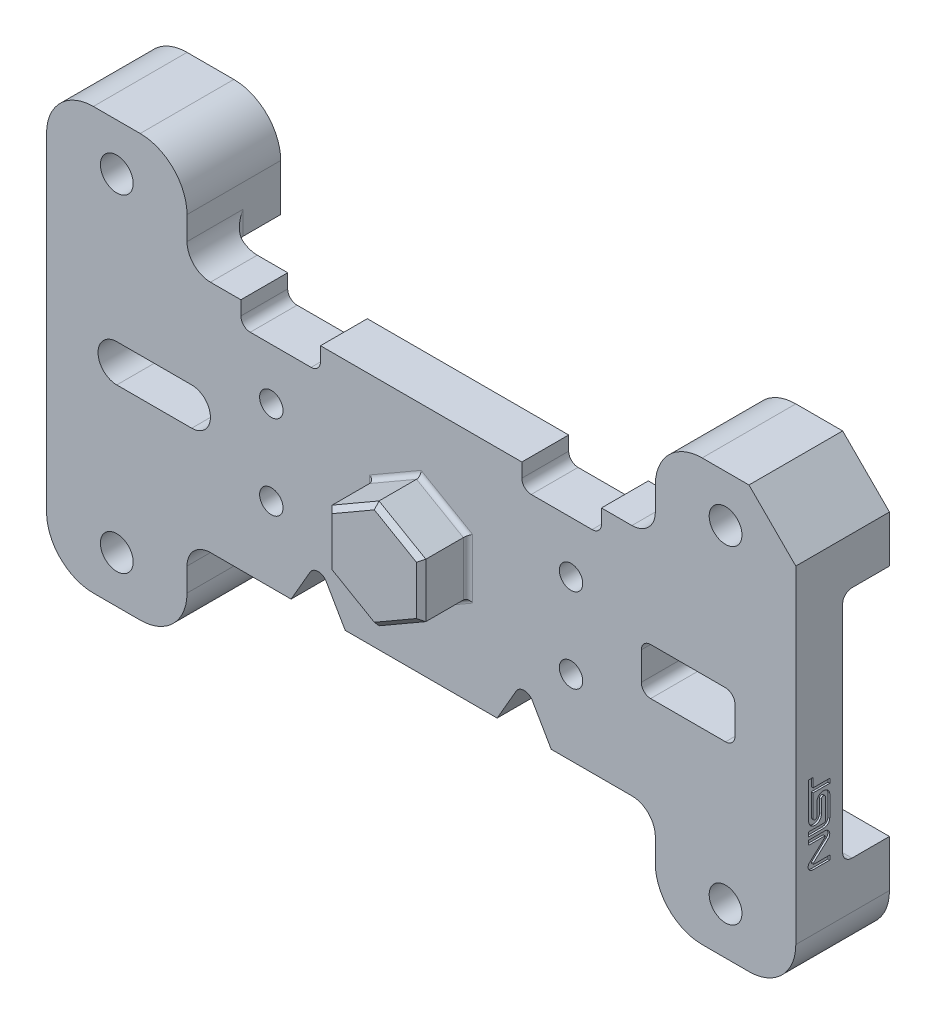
from build123d import *

# Parameters (mm, degrees)
BOSS_EXTRUDE1_DEPTH         = 100
BOSS_EXTRUDE2_DEPTH         = 50
CUT_EXTRUDE1_DEPTH          = 50
FILLET1_R                   = 10
F_20MM_DIAMETER_HOLE1_D     = 20
F_20MM_DIAMETER_HOLE1_DEPTH = 45
F_20MM_DIAMETER_HOLE1_TIP   = 6.00860619
F_35MM_DIAMETER_HOLE1_D     = 35
F_25MM_DIAMETER_HOLE2_D     = 25
FILLET2_R                   = 5
CHAMFER1_SIZE               = 5
CUT_EXTRUDE2_DEPTH          = 2


with BuildPart() as part:
    # Sketch1 → Boss-Extrude1 (new body)
    with BuildSketch(Plane.XY):
        with BuildLine():
            Line((300, -225), (350, -225))
            ThreePointArc((350, -225), (385.355339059, -210.355339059), (400, -175))
            Line((400, -175), (400, 175))
            Line((400, 175), (350, 225))
            Line((350, 225), (300, 225))
            ThreePointArc((300, 225), (264.644660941, 210.355339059), (250, 175))
            Line((250, 175), (250, 150))
            ThreePointArc((250, 150), (242.67766953, 132.32233047), (225, 125))
            Line((225, 125), (192.5, 125))
            Line((192.5, 125), (192.5, 110))
            ThreePointArc((192.5, 110), (189.571067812, 102.928932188), (182.5, 100))
            Line((182.5, 100), (117.5, 100))
            ThreePointArc((117.5, 100), (110.428932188, 102.928932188), (107.5, 110))
            Line((107.5, 110), (107.5, 125))
            Line((107.5, 125), (-107.5, 125))
            Line((-107.5, 125), (-107.5, 110))
            ThreePointArc((-107.5, 110), (-110.428932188, 102.928932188), (-117.5, 100))
            Line((-117.5, 100), (-182.5, 100))
            ThreePointArc((-182.5, 100), (-189.571067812, 102.928932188), (-192.5, 110))
            Line((-192.5, 110), (-192.5, 125))
            Line((-192.5, 125), (-225, 125))
            ThreePointArc((-225, 125), (-242.67766953, 132.32233047), (-250, 150))
            Line((-250, 150), (-250, 175))
            ThreePointArc((-250, 175), (-264.644660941, 210.355339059), (-300, 225))
            Line((-300, 225), (-350, 225))
            ThreePointArc((-350, 225), (-385.355339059, 210.355339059), (-400, 175))
            Line((-400, 175), (-400, -175))
            ThreePointArc((-400, -175), (-385.355339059, -210.355339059), (-350, -225))
            Line((-350, -225), (-300, -225))
            ThreePointArc((-300, -225), (-264.644660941, -210.355339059), (-250, -175))
            Line((-250, -175), (-250, -150))
            ThreePointArc((-250, -150), (-242.67766953, -132.32233047), (-225, -125))
            Line((-225, -125), (-138.867513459, -125))
            Line((-138.867513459, -125), (-118.660254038, -90))
            ThreePointArc((-118.660254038, -90), (-110, -85), (-101.339745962, -90))
            Line((-101.339745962, -90), (-81.132486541, -125))
            Line((-81.132486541, -125), (81.132486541, -125))
            Line((81.132486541, -125), (101.339745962, -90))
            ThreePointArc((101.339745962, -90), (110, -85), (118.660254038, -90))
            Line((118.660254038, -90), (138.867513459, -125))
            Line((138.867513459, -125), (225, -125))
            ThreePointArc((225, -125), (242.67766953, -132.32233047), (250, -150))
            Line((250, -150), (250, -175))
            ThreePointArc((250, -175), (264.644660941, -210.355339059), (300, -225))
        make_face()
        with BuildLine():
            Line((245, 25), (325, 25))
            ThreePointArc((325, 25), (332.071067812, 22.071067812), (335, 15))
            Line((335, 15), (335, -15))
            ThreePointArc((335, -15), (332.071067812, -22.071067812), (325, -25))
            Line((325, -25), (245, -25))
            ThreePointArc((245, -25), (237.928932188, -22.071067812), (235, -15))
            Line((235, -15), (235, 15))
            ThreePointArc((235, 15), (237.928932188, 22.071067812), (245, 25))
        make_face(mode=Mode.SUBTRACT)
        with BuildLine():
            Line((-325, 20), (-245, 20))
            ThreePointArc((-245, 20), (-225, 0), (-245, -20))
            Line((-245, -20), (-325, -20))
            ThreePointArc((-325, -20), (-345, 0), (-325, 20))
        make_face(mode=Mode.SUBTRACT)
    extrude(amount=-BOSS_EXTRUDE1_DEPTH)

    # Sketch2 → Boss-Extrude2 (add)
    with BuildSketch(Plane.XY):
        Polygon((0, 57.735026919), (-50, 28.867513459), (-50, -28.867513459), (0, -57.735026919), (50, -28.867513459), (50, 28.867513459), align=None)
    extrude(amount=BOSS_EXTRUDE2_DEPTH)

    # Sketch3 → Cut-Extrude1 (cut)
    with BuildSketch(Plane(origin=(0, 0, -100), x_dir=(-1, 0, 0), z_dir=(0, 0, -1))):
        Polygon((-250, -125), (-250, -285.839323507), (250, -285.839323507), (250, -125), (518.137746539, -125), (518.137746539, 125), (250, 125), (250, 257.341747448), (-250, 257.341747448), (-250, 125), (-508.638554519, 125), (-508.638554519, -125), align=None)
    extrude(amount=-CUT_EXTRUDE1_DEPTH, mode=Mode.SUBTRACT)

    # Fillet1
    fillet1_edges = [part.edges().sort_by_distance(p)[0] for p in [
        (250, 137.5, -50),
        (-250, -137.5, -50),
        (-250, 137.5, -50),
        (-325, 125, -50),
        (-325, -125, -50),
        (250, -137.5, -50),
        (325, -125, -50),
        (325, 125, -50),
    ]]
    fillet(fillet1_edges, radius=FILLET1_R)

    # 20mm Diameter Hole1
    with Locations(Plane(origin=(0, -125, 0), x_dir=(-1, 0, 0), z_dir=(0, -1, 0))):
        with Locations((30, 25), (-30, 25)):
            Hole(F_20MM_DIAMETER_HOLE1_D / 2, depth=F_20MM_DIAMETER_HOLE1_DEPTH)
            with Locations((0, 0, -(F_20MM_DIAMETER_HOLE1_DEPTH + F_20MM_DIAMETER_HOLE1_TIP / 2))):  # 118° drill point
                Cone(0, F_20MM_DIAMETER_HOLE1_D / 2, F_20MM_DIAMETER_HOLE1_TIP, mode=Mode.SUBTRACT)

    # 35mm Diameter Hole1 (through all)
    with Locations(Plane.XY):
        with Locations((-325, -175), (-325, 175), (325, 175), (325, -175)):
            Hole(F_35MM_DIAMETER_HOLE1_D / 2)

    # 25mm Diameter Hole2 (through all)
    with Locations(Plane.XY):
        with Locations((-160, 45), (-160, -45), (160, -45), (160, 45)):
            Hole(F_25MM_DIAMETER_HOLE2_D / 2)

    # Fillet2
    fillet2_edges = [part.edges().sort_by_distance(p)[0] for p in [
        (25, 43.301270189, 0),
        (-25, 43.301270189, 0),
        (-50, 0, 0),
        (-25, -43.301270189, 0),
        (25, -43.301270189, 0),
        (50, 0, 0),
    ]]
    fillet(fillet2_edges, radius=FILLET2_R)

    # Chamfer1
    chamfer1_edges = [part.edges().sort_by_distance(p)[0] for p in [
        (25, 43.301270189, 50),
        (-25, 43.301270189, 50),
        (-50, 0, 50),
        (-25, -43.301270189, 50),
        (25, -43.301270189, 50),
        (50, 0, 50),
    ]]
    chamfer(chamfer1_edges, length=CHAMFER1_SIZE)

    # Sketch13 → Cut-Extrude2 (cut)
    with BuildSketch(Plane(origin=(400, 0, 0), x_dir=(0, 0, -1), z_dir=(1, 0, 0))):
        with BuildLine():
            Line((13.75, -82.32835225), (29.956393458, -82.32835225))
            ThreePointArc((29.956393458, -82.32835225), (34.406645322, -80.484997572), (36.25, -76.034745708))
            Line((36.25, -76.034745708), (36.25, -53.234015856))
            ThreePointArc((36.25, -53.234015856), (29.482803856, -47.459191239), (22.715607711, -53.234015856))
            Line((22.715607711, -53.234015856), (22.715607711, -67.674157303))
            ThreePointArc((22.715607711, -67.674157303), (20.513731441, -69.787963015), (18.491515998, -67.501682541))
            Line((18.491515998, -67.501682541), (18.491515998, -43.966577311))
            Line((18.491515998, -43.966577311), (36.25, -43.966577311))
            Line((36.25, -43.966577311), (36.25, -39.312838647))
            Line((36.25, -39.312838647), (18.491515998, -39.312838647))
            Line((18.491515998, -39.312838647), (18.491515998, -29.698910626))
            Line((18.491515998, -29.698910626), (13.75, -29.698910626))
            Line((13.75, -29.698910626), (13.75, -68.103804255))
            ThreePointArc((13.75, -68.103804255), (20.828211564, -74.919002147), (27.37062967, -67.587919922))
            Line((27.37062967, -67.587919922), (27.37062967, -54.010152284))
            ThreePointArc((27.37062967, -54.010152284), (29.444202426, -52.069736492), (31.5952347, -53.923914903))
            Line((31.5952347, -53.923914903), (31.5952347, -75.9911137))
            ThreePointArc((31.5952347, -75.9911137), (31.115229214, -77.149949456), (29.956393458, -77.629954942))
            Line((29.956393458, -77.629954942), (13.75, -77.629954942))
            Line((13.75, -77.629954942), (13.75, -82.32835225))
        make_face()
        with BuildLine():
            Line((36.25, -115), (18.006862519, -115))
            ThreePointArc((18.006862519, -115), (13.452018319, -111.891741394), (14.685882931, -106.517222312))
            Line((14.685882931, -106.517222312), (31.336522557, -91.119945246))
            ThreePointArc((31.336522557, -91.119945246), (31.483410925, -90.412511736), (30.862216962, -90.043517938))
            Line((30.862216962, -90.043517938), (13.75, -90.043517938))
            Line((13.75, -90.043517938), (13.75, -85.34512063))
            Line((13.75, -85.34512063), (30.974287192, -85.34512063))
            ThreePointArc((30.974287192, -85.34512063), (35.952415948, -88.87401355), (34.270863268, -94.739781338))
            Line((34.270863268, -94.739781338), (18.836465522, -108.940513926))
            ThreePointArc((18.836465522, -108.940513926), (18.630325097, -109.830724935), (19.384773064, -110.346261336))
            Line((19.384773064, -110.346261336), (36.25, -110.346261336))
            Line((36.25, -110.346261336), (36.25, -115))
        make_face()
    extrude(amount=-CUT_EXTRUDE2_DEPTH, mode=Mode.SUBTRACT)


solid = part.part
